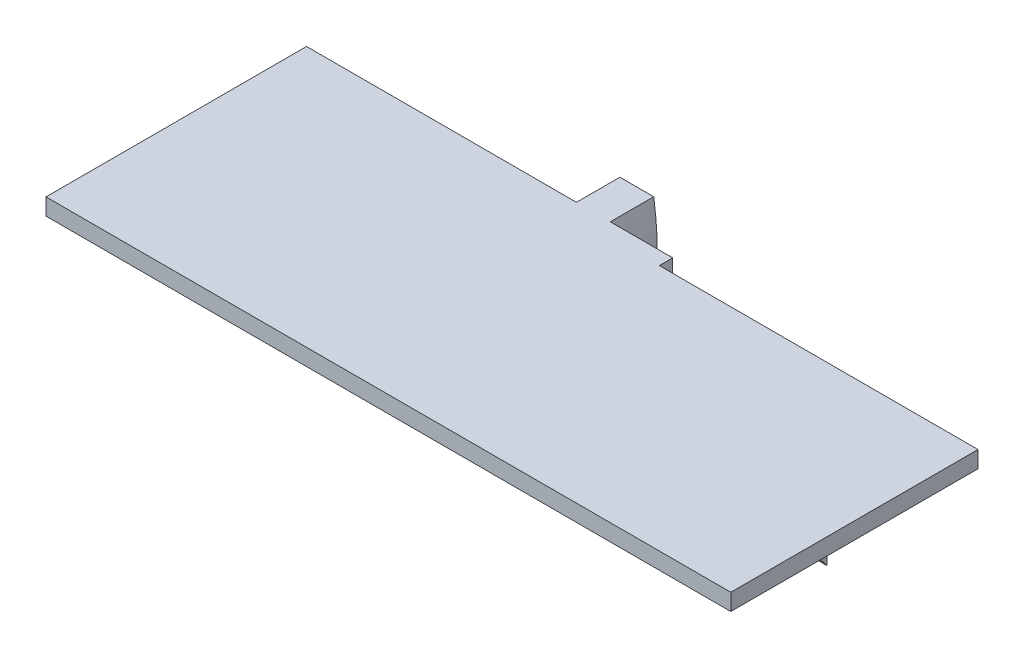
from build123d import *

# Parameters (mm, degrees)
SKETCH1_W              = 205
SKETCH1_H              = 78
BOSS_EXTRUDE1_DEPTH    = 5
SKETCH4_W              = 95.4
SKETCH4_H              = 4
CUTFORSIDEPLATE_DEPTH  = 110.782739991
NEEDLEBASE_DEPTH       = 13
NEEDLEPOINT_START      = 8
NEEDLEPOINT_DEPTH      = 5
SIDEPLATESUPPORT_DEPTH = 2.5


with BuildPart() as part:
    # Sketch1 → Boss-Extrude1 (new body)
    with BuildSketch(Plane(origin=(0, 0, 0), x_dir=(1, 0, 0), z_dir=(0, 1, 0))):
        Rectangle(SKETCH1_W, SKETCH1_H)
    extrude(amount=BOSS_EXTRUDE1_DEPTH)

    # Sketch4 → CutForSidePlate (cut, through all)
    with BuildSketch(Plane(origin=(0, 5, 0), x_dir=(1, 0, 0), z_dir=(0, 1, 0))):
        with Locations((54.8, 37)):
            Rectangle(SKETCH4_W, SKETCH4_H)
    extrude(amount=-CUTFORSIDEPLATE_DEPTH, mode=Mode.SUBTRACT)

    # Sketch2 → NeedleBase (add)
    with BuildSketch(Plane(origin=(0, 0, -39), x_dir=(-1, 0, 0), z_dir=(0, 0, -1))):
        with BuildLine():
            Line((20.5, -9), (10.5, -9))
            ThreePointArc((10.5, -9), (10.768255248, -1.979529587), (11.571456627, 5))
            Line((11.571456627, 5), (21.703960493, 5))
            ThreePointArc((21.703960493, 5), (20.801544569, -1.97416338), (20.5, -9))
        make_face()
        with BuildLine():
            Line((21.703960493, 5), (11.571456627, 5))
            ThreePointArc((11.571456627, 5), (10.768255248, -1.979529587), (10.5, -9))
            Line((10.5, -9), (20.5, -9))
            ThreePointArc((20.5, -9), (20.801544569, -1.97416338), (21.703960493, 5))
        make_face()
    extrude(amount=NEEDLEBASE_DEPTH)

    # Sketch2_5 → NeedlePoint (add)
    with BuildSketch(Plane(origin=(0, 0, -39), x_dir=(-1, 0, 0), z_dir=(0, 0, -1)).offset(NEEDLEPOINT_START)):
        with BuildLine():
            Line((30.5, -9), (21.703960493, 5))
            ThreePointArc((21.703960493, 5), (20.801544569, -1.97416338), (20.5, -9))
            Line((20.5, -9), (30.5, -9))
        make_face()
    extrude(amount=NEEDLEPOINT_DEPTH)

    # Sketch9 → SidePlateSupport (add, symmetric)
    with BuildSketch(Plane(origin=(54.8, 0, 0), x_dir=(0, 0, -1), z_dir=(1, 0, 0))):
        Polygon((-2, 0), (35, 0), (35, -47.7), align=None)
    extrude(amount=SIDEPLATESUPPORT_DEPTH, both=True)


solid = part.part
